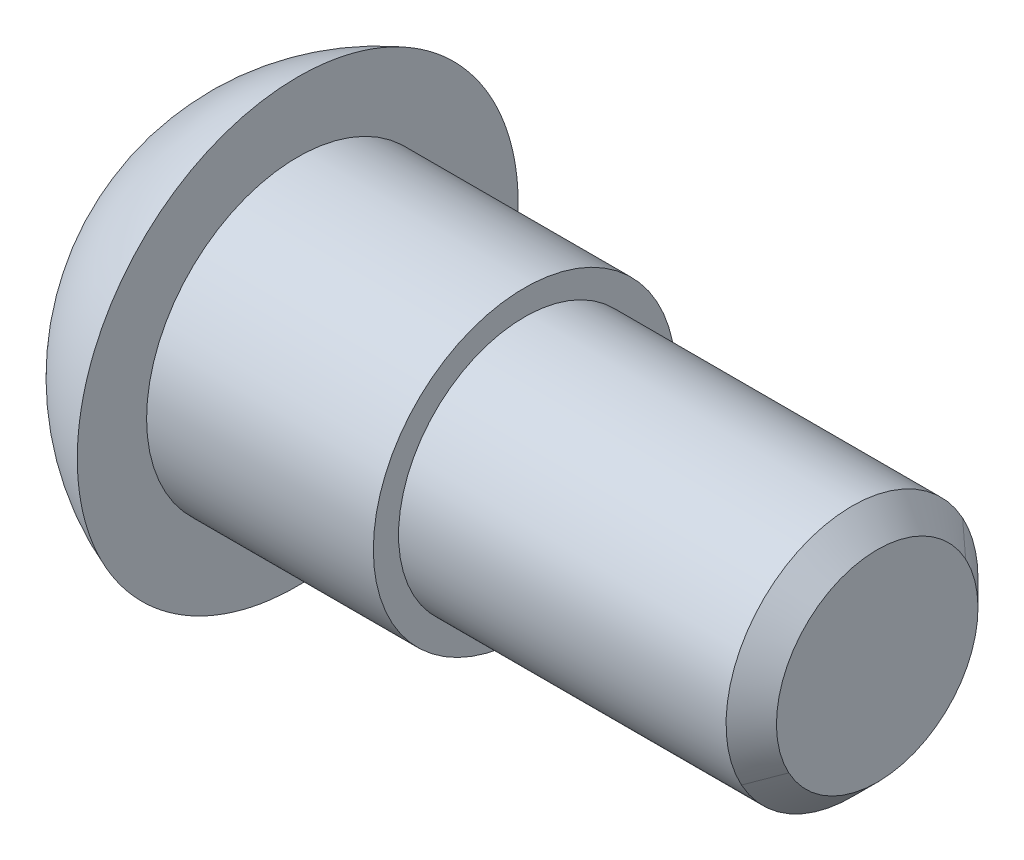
ISO-10303-21;
HEADER;
FILE_DESCRIPTION(('STEP AP214'),'2;1');
FILE_NAME('part.step','',(''),(''),'','','');
FILE_SCHEMA(('AUTOMOTIVE_DESIGN { 1 0 10303 214 1 1 1 1 }'));
ENDSEC;
DATA;
#1=APPLICATION_CONTEXT('core data for automotive mechanical design processes');
#2=APPLICATION_PROTOCOL_DEFINITION('international standard','automotive_design',2000,#1);
#3=PRODUCT_CONTEXT('',#1,'mechanical');
#4=PRODUCT('Part','Part','',(#3));
#5=PRODUCT_RELATED_PRODUCT_CATEGORY('part','',(#4));
#6=PRODUCT_DEFINITION_FORMATION('','',#4);
#7=PRODUCT_DEFINITION_CONTEXT('part definition',#1,'design');
#8=PRODUCT_DEFINITION('design','',#6,#7);
#9=PRODUCT_DEFINITION_SHAPE('','',#8);
#10=(LENGTH_UNIT() NAMED_UNIT(*) SI_UNIT(.MILLI.,.METRE.));
#11=(NAMED_UNIT(*) PLANE_ANGLE_UNIT() SI_UNIT($,.RADIAN.));
#12=(NAMED_UNIT(*) SI_UNIT($,.STERADIAN.) SOLID_ANGLE_UNIT());
#13=UNCERTAINTY_MEASURE_WITH_UNIT(LENGTH_MEASURE(1.E-05),#10,'distance_accuracy_value','');
#14=(GEOMETRIC_REPRESENTATION_CONTEXT(3) GLOBAL_UNCERTAINTY_ASSIGNED_CONTEXT((#13)) GLOBAL_UNIT_ASSIGNED_CONTEXT((#10,
#11,#12)) REPRESENTATION_CONTEXT('',''));
#15=CARTESIAN_POINT('',(0.,0.,0.));
#16=DIRECTION('',(0.,0.,1.));
#17=DIRECTION('',(1.,0.,0.));
#18=AXIS2_PLACEMENT_3D('',#15,#16,#17);
#19=CARTESIAN_POINT('',(-2.05766977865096,0.,0.));
#20=DIRECTION('',(-1.,0.,0.));
#21=DIRECTION('',(0.,0.,1.));
#22=AXIS2_PLACEMENT_3D('',#19,#20,#21);
#23=CONICAL_SURFACE('',#22,2.90497562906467,1.04719755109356);
#24=CARTESIAN_POINT('',(-2.04766666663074,-2.50077802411,-1.4438248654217));
#25=CARTESIAN_POINT('',(-2.01344823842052,-2.50077802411,-1.32530116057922));
#26=CARTESIAN_POINT('',(-1.98212030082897,-2.50077802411,-1.20583982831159));
#27=CARTESIAN_POINT('',(-1.92675205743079,-2.50077802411,-0.964976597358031));
#28=CARTESIAN_POINT('',(-1.90272805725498,-2.50077802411,-0.843570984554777));
#29=CARTESIAN_POINT('',(-1.8640945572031,-2.50077802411,-0.602122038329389));
#30=CARTESIAN_POINT('',(-1.84927907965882,-2.50077802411,-0.482112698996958));
#31=CARTESIAN_POINT('',(-1.82939017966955,-2.50077802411,-0.241401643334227));
#32=CARTESIAN_POINT('',(-1.82430618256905,-2.50077802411,-0.120700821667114));
#33=CARTESIAN_POINT('',(-1.82430618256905,-2.50077802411,0.120700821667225));
#34=CARTESIAN_POINT('',(-1.82939017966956,-2.50077802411,0.241401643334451));
#35=CARTESIAN_POINT('',(-1.84927907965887,-2.50077802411,0.482112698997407));
#36=CARTESIAN_POINT('',(-1.86409455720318,-2.50077802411,0.602122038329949));
#37=CARTESIAN_POINT('',(-1.90272805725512,-2.50077802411,0.843570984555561));
#38=CARTESIAN_POINT('',(-1.92675205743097,-2.50077802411,0.964976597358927));
#39=CARTESIAN_POINT('',(-1.98212030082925,-2.50077802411,1.20583982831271));
#40=CARTESIAN_POINT('',(-2.01344823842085,-2.50077802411,1.32530116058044));
#41=CARTESIAN_POINT('',(-2.04766666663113,-2.50077802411,1.44382486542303));
#42=B_SPLINE_CURVE_WITH_KNOTS('',3,(#24,#25,#26,#27,#28,#29,#30,#31,#32,#33,#34,#35,#36,#37,#38,
#39,#40,#41),.UNSPECIFIED.,.F.,.F.,(4,2,2,2,2,2,2,2,4),(0.,0.370206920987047,0.741234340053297,
1.10363192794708,1.46563549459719,1.82763906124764,2.19003664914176,2.56106406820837,
2.93127098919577),.UNSPECIFIED.);
#43=CARTESIAN_POINT('',(-2.04766666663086,-2.50077802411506,-1.44382486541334));
#44=VERTEX_POINT('',#43);
#45=CARTESIAN_POINT('',(-2.04766666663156,-2.50077802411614,1.44382486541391));
#46=VERTEX_POINT('',#45);
#47=EDGE_CURVE('E87',#44,#46,#42,.T.);
#48=ORIENTED_EDGE('',*,*,#47,.T.);
#49=CARTESIAN_POINT('',(-2.04766666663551,-2.50077802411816,1.44382486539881));
#50=CARTESIAN_POINT('',(-2.01102469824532,-2.3908839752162,1.5072722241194));
#51=CARTESIAN_POINT('',(-1.97770074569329,-2.2800413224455,1.57126725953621));
#52=CARTESIAN_POINT('',(-1.91953478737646,-2.05643685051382,1.70036536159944));
#53=CARTESIAN_POINT('',(-1.8947133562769,-1.94367105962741,1.7654707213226));
#54=CARTESIAN_POINT('',(-1.85607700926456,-1.71953692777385,1.89487462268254));
#55=CARTESIAN_POINT('',(-1.84200491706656,-1.60820306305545,1.9591532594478));
#56=CARTESIAN_POINT('',(-1.82520891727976,-1.38501174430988,2.0880128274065));
#57=CARTESIAN_POINT('',(-1.82247109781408,-1.27315510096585,2.15259329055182));
#58=CARTESIAN_POINT('',(-1.82818124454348,-1.06416296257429,2.27325495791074));
#59=CARTESIAN_POINT('',(-1.83522718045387,-0.966996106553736,2.32935426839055));
#60=CARTESIAN_POINT('',(-1.85755414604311,-0.773295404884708,2.44118742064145));
#61=CARTESIAN_POINT('',(-1.87284279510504,-0.676762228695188,2.49692087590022));
#62=CARTESIAN_POINT('',(-1.91106145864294,-0.482662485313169,2.60898441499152));
#63=CARTESIAN_POINT('',(-1.93415340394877,-0.385120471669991,2.66530032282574));
#64=CARTESIAN_POINT('',(-1.98656235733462,-0.191490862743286,2.77709242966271));
#65=CARTESIAN_POINT('',(-2.01586705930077,-0.0954007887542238,2.83257005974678));
#66=CARTESIAN_POINT('',(-2.04766666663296,8.40144272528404E-12,2.88764973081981));
#67=B_SPLINE_CURVE_WITH_KNOTS('',3,(#49,#50,#51,#52,#53,#54,#55,#56,#57,#58,#59,#60,#61,#62,#63,
#64,#65,#66),.UNSPECIFIED.,.F.,.F.,(4,2,2,2,2,2,2,2,4),(0.,0.396393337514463,0.793739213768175,
1.18125201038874,1.56828902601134,1.90522746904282,2.24247790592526,2.58720694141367,
2.93125941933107),.UNSPECIFIED.);
#68=CARTESIAN_POINT('',(-2.04766666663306,-2.97348732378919E-13,2.88764973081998));
#69=VERTEX_POINT('',#68);
#70=EDGE_CURVE('E90',#46,#69,#67,.T.);
#71=ORIENTED_EDGE('',*,*,#70,.T.);
#72=CARTESIAN_POINT('',(-2.04766666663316,-8.99585790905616E-12,2.88764973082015));
#73=CARTESIAN_POINT('',(-2.01102469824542,0.109894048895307,2.82420237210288));
#74=CARTESIAN_POINT('',(-1.97770074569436,0.220736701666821,2.76020733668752));
#75=CARTESIAN_POINT('',(-1.9195347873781,0.444341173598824,2.63110923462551));
#76=CARTESIAN_POINT('',(-1.89471335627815,0.557106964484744,2.56600387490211));
#77=CARTESIAN_POINT('',(-1.85607700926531,0.781241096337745,2.43659997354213));
#78=CARTESIAN_POINT('',(-1.8420049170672,0.892574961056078,2.37232133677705));
#79=CARTESIAN_POINT('',(-1.82520891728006,1.1157662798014,2.24346176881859));
#80=CARTESIAN_POINT('',(-1.82247109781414,1.22762292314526,2.17888130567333));
#81=CARTESIAN_POINT('',(-1.82818124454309,1.43661506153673,2.05821963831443));
#82=CARTESIAN_POINT('',(-1.83522718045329,1.53378191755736,2.00212032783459));
#83=CARTESIAN_POINT('',(-1.85755414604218,1.72748261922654,1.89028717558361));
#84=CARTESIAN_POINT('',(-1.87284279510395,1.82401579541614,1.83455372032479));
#85=CARTESIAN_POINT('',(-1.91106145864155,2.01811553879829,1.7224901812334));
#86=CARTESIAN_POINT('',(-1.93415340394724,2.11565755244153,1.66617427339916));
#87=CARTESIAN_POINT('',(-1.98656235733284,2.30928716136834,1.55438216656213));
#88=CARTESIAN_POINT('',(-2.01586705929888,2.40537723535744,1.49890453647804));
#89=CARTESIAN_POINT('',(-2.04766666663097,2.50077802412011,1.44382486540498));
#90=B_SPLINE_CURVE_WITH_KNOTS('',3,(#72,#73,#74,#75,#76,#77,#78,#79,#80,#81,#82,#83,#84,#85,#86,
#87,#88,#89),.UNSPECIFIED.,.F.,.F.,(4,2,2,2,2,2,2,2,4),(0.,0.396393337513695,0.793739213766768,
1.18125201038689,1.56828902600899,1.90522746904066,2.24247790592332,2.58720694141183,
2.93125941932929),.UNSPECIFIED.);
#91=CARTESIAN_POINT('',(-2.04766666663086,2.50077802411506,1.44382486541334));
#92=VERTEX_POINT('',#91);
#93=EDGE_CURVE('E124',#69,#92,#90,.T.);
#94=ORIENTED_EDGE('',*,*,#93,.T.);
#95=CARTESIAN_POINT('',(-2.04766666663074,2.50077802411,1.4438248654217));
#96=CARTESIAN_POINT('',(-2.01344823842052,2.50077802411,1.32530116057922));
#97=CARTESIAN_POINT('',(-1.98212030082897,2.50077802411,1.20583982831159));
#98=CARTESIAN_POINT('',(-1.92675205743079,2.50077802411,0.964976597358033));
#99=CARTESIAN_POINT('',(-1.90272805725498,2.50077802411,0.84357098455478));
#100=CARTESIAN_POINT('',(-1.8640945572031,2.50077802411,0.602122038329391));
#101=CARTESIAN_POINT('',(-1.84927907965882,2.50077802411,0.48211269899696));
#102=CARTESIAN_POINT('',(-1.82939017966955,2.50077802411,0.241401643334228));
#103=CARTESIAN_POINT('',(-1.82430618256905,2.50077802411,0.120700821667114));
#104=CARTESIAN_POINT('',(-1.82430618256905,2.50077802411,-0.120700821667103));
#105=CARTESIAN_POINT('',(-1.82939017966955,2.50077802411,-0.241401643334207));
#106=CARTESIAN_POINT('',(-1.84927907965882,2.50077802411,-0.482112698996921));
#107=CARTESIAN_POINT('',(-1.8640945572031,2.50077802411,-0.602122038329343));
#108=CARTESIAN_POINT('',(-1.90272805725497,2.50077802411,-0.843570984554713));
#109=CARTESIAN_POINT('',(-1.92675205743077,2.50077802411,-0.964976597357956));
#110=CARTESIAN_POINT('',(-1.98212030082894,2.50077802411,-1.2058398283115));
#111=CARTESIAN_POINT('',(-2.01344823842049,2.50077802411,-1.32530116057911));
#112=CARTESIAN_POINT('',(-2.04766666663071,2.50077802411,-1.44382486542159));
#113=B_SPLINE_CURVE_WITH_KNOTS('',3,(#95,#96,#97,#98,#99,#100,#101,#102,#103,#104,#105,#106,
#107,#108,#109,#110,#111,#112),.UNSPECIFIED.,.F.,.F.,(4,2,2,2,2,2,2,2,4),(0.,0.370206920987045,
0.741234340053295,1.10363192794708,1.46563549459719,1.82763906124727,2.19003664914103,
2.56106406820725,2.93127098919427),.UNSPECIFIED.);
#114=CARTESIAN_POINT('',(-2.04766666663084,2.50077802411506,-1.44382486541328));
#115=VERTEX_POINT('',#114);
#116=EDGE_CURVE('E129',#92,#115,#113,.T.);
#117=ORIENTED_EDGE('',*,*,#116,.T.);
#118=CARTESIAN_POINT('',(-2.04766666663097,2.50077802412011,-1.44382486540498));
#119=CARTESIAN_POINT('',(-2.01102469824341,2.39088397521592,-1.50727222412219));
#120=CARTESIAN_POINT('',(-1.97770074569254,2.28004132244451,-1.57126725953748));
#121=CARTESIAN_POINT('',(-1.91953478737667,2.05643685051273,-1.70036536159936));
#122=CARTESIAN_POINT('',(-1.89471335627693,1.94367105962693,-1.7654707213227));
#123=CARTESIAN_POINT('',(-1.8560770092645,1.71953692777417,-1.89487462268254));
#124=CARTESIAN_POINT('',(-1.84200491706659,1.60820306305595,-1.95915325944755));
#125=CARTESIAN_POINT('',(-1.82520891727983,1.38501174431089,-2.08801282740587));
#126=CARTESIAN_POINT('',(-1.82247109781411,1.27315510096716,-2.15259329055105));
#127=CARTESIAN_POINT('',(-1.82818124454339,1.0641629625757,-2.27325495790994));
#128=CARTESIAN_POINT('',(-1.83522718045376,0.966996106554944,-2.32935426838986));
#129=CARTESIAN_POINT('',(-1.85755414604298,0.773295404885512,-2.44118742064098));
#130=CARTESIAN_POINT('',(-1.87284279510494,0.676762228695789,-2.49692087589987));
#131=CARTESIAN_POINT('',(-1.91106145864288,0.482662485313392,-2.60898441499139));
#132=CARTESIAN_POINT('',(-1.93415340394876,0.385120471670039,-2.66530032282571));
#133=CARTESIAN_POINT('',(-1.9865623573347,0.191490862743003,-2.77709242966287));
#134=CARTESIAN_POINT('',(-2.01586705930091,0.0954007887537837,-2.83257005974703));
#135=CARTESIAN_POINT('',(-2.04766666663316,-8.99572751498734E-12,-2.88764973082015));
#136=B_SPLINE_CURVE_WITH_KNOTS('',3,(#118,#119,#120,#121,#122,#123,#124,#125,#126,#127,#128,
#129,#130,#131,#132,#133,#134,#135),.UNSPECIFIED.,.F.,.F.,(4,2,2,2,2,2,2,2,4),(0.,
0.396393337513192,0.793739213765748,1.18125201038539,1.56828902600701,1.90522746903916,
2.24247790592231,2.58720694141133,2.9312594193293),.UNSPECIFIED.);
#137=CARTESIAN_POINT('',(-2.0476666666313,-5.57113034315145E-12,-2.88764973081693));
#138=VERTEX_POINT('',#137);
#139=EDGE_CURVE('E20',#115,#138,#136,.T.);
#140=ORIENTED_EDGE('',*,*,#139,.T.);
#141=CARTESIAN_POINT('',(-2.04766666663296,8.40110502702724E-12,-2.88764973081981));
#142=CARTESIAN_POINT('',(-2.01102469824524,-0.109894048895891,-2.82420237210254));
#143=CARTESIAN_POINT('',(-1.97770074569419,-0.220736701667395,-2.76020733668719));
#144=CARTESIAN_POINT('',(-1.91953478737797,-0.444341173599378,-2.63110923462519));
#145=CARTESIAN_POINT('',(-1.89471335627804,-0.557106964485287,-2.5660038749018));
#146=CARTESIAN_POINT('',(-1.85607700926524,-0.781241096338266,-2.43659997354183));
#147=CARTESIAN_POINT('',(-1.84200491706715,-0.892574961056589,-2.37232133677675));
#148=CARTESIAN_POINT('',(-1.82520891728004,-1.11576627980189,-2.2434617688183));
#149=CARTESIAN_POINT('',(-1.82247109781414,-1.22762292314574,-2.17888130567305));
#150=CARTESIAN_POINT('',(-1.82818124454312,-1.43661506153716,-2.05821963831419));
#151=CARTESIAN_POINT('',(-1.83522718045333,-1.53378191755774,-2.00212032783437));
#152=CARTESIAN_POINT('',(-1.85755414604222,-1.72748261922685,-1.89028717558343));
#153=CARTESIAN_POINT('',(-1.872842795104,-1.82401579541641,-1.83455372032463));
#154=CARTESIAN_POINT('',(-1.91106145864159,-2.01811553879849,-1.72249018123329));
#155=CARTESIAN_POINT('',(-1.93415340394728,-2.11565755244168,-1.66617427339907));
#156=CARTESIAN_POINT('',(-1.98656235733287,-2.30928716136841,-1.55438216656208));
#157=CARTESIAN_POINT('',(-2.01586705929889,-2.40537723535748,-1.49890453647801));
#158=CARTESIAN_POINT('',(-2.04766666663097,-2.50077802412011,-1.44382486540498));
#159=B_SPLINE_CURVE_WITH_KNOTS('',3,(#141,#142,#143,#144,#145,#146,#147,#148,#149,#150,#151,
#152,#153,#154,#155,#156,#157,#158),.UNSPECIFIED.,.F.,.F.,(4,2,2,2,2,2,2,2,4),(0.,
0.396393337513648,0.793739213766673,1.18125201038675,1.56828902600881,1.90522746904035,
2.24247790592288,2.58720694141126,2.93125941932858),.UNSPECIFIED.);
#160=EDGE_CURVE('E93',#138,#44,#159,.T.);
#161=ORIENTED_EDGE('',*,*,#160,.T.);
#162=EDGE_LOOP('',(#48,#71,#94,#117,#140,#161));
#163=FACE_BOUND('',#162,.T.);
#164=CARTESIAN_POINT('',(-0.380481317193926,-3.41060513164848E-10,0.));
#165=VERTEX_POINT('',#164);
#166=VERTEX_LOOP('',#165);
#167=FACE_BOUND('',#166,.T.);
#168=ADVANCED_FACE('F16',(#163,#167),#23,.F.);
#169=CARTESIAN_POINT('',(-5.501,1.25038901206,-2.16573729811));
#170=DIRECTION('',(0.,0.50000000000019,-0.866025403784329));
#171=DIRECTION('',(0.,0.866025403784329,0.50000000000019));
#172=AXIS2_PLACEMENT_3D('',#169,#170,#171);
#173=PLANE('',#172);
#174=DIRECTION('',(0.,0.86602540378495,0.499999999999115));
#175=VECTOR('',#174,1.);
#176=CARTESIAN_POINT('',(-5.5,0.,-2.88764973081));
#177=LINE('',#176,#175);
#178=CARTESIAN_POINT('',(-5.5,-2.1462866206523E-12,-2.88764973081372));
#179=VERTEX_POINT('',#178);
#180=CARTESIAN_POINT('',(-5.5,2.50077802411,-1.4438248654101));
#181=VERTEX_POINT('',#180);
#182=EDGE_CURVE('E132',#179,#181,#177,.T.);
#183=ORIENTED_EDGE('',*,*,#182,.F.);
#184=DIRECTION('',(1.,0.,0.));
#185=VECTOR('',#184,1.);
#186=CARTESIAN_POINT('',(-5.501,-2.1462866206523E-12,-2.88764973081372));
#187=LINE('',#186,#185);
#188=EDGE_CURVE('E136',#179,#138,#187,.T.);
#189=ORIENTED_EDGE('',*,*,#188,.T.);
#190=ORIENTED_EDGE('',*,*,#139,.F.);
#191=DIRECTION('',(1.,0.,0.));
#192=VECTOR('',#191,1.);
#193=CARTESIAN_POINT('',(-5.501,2.50077802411,-1.44382486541));
#194=LINE('',#193,#192);
#195=EDGE_CURVE('E127',#115,#181,#194,.F.);
#196=ORIENTED_EDGE('',*,*,#195,.T.);
#197=EDGE_LOOP('',(#183,#189,#190,#196));
#198=FACE_BOUND('',#197,.T.);
#199=ADVANCED_FACE('F238',(#198),#173,.F.);
#200=CARTESIAN_POINT('',(-5.501,2.50077802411,0.));
#201=DIRECTION('',(0.,1.,0.));
#202=DIRECTION('',(0.,0.,1.));
#203=AXIS2_PLACEMENT_3D('',#200,#201,#202);
#204=PLANE('',#203);
#205=DIRECTION('',(1.,0.,0.));
#206=VECTOR('',#205,1.);
#207=CARTESIAN_POINT('',(-5.501,2.50077802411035,1.44382486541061));
#208=LINE('',#207,#206);
#209=CARTESIAN_POINT('',(-5.5,2.50077802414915,1.44382486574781));
#210=VERTEX_POINT('',#209);
#211=EDGE_CURVE('E105',#92,#210,#208,.F.);
#212=ORIENTED_EDGE('',*,*,#211,.T.);
#213=DIRECTION('',(0.,0.,1.));
#214=VECTOR('',#213,1.);
#215=CARTESIAN_POINT('',(-5.5,2.50077802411,0.));
#216=LINE('',#215,#214);
#217=EDGE_CURVE('E135',#181,#210,#216,.T.);
#218=ORIENTED_EDGE('',*,*,#217,.F.);
#219=ORIENTED_EDGE('',*,*,#195,.F.);
#220=ORIENTED_EDGE('',*,*,#116,.F.);
#221=EDGE_LOOP('',(#212,#218,#219,#220));
#222=FACE_BOUND('',#221,.T.);
#223=ADVANCED_FACE('F233',(#222),#204,.F.);
#224=CARTESIAN_POINT('',(-5.501,1.25038901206,2.16573729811));
#225=DIRECTION('',(0.,0.50000000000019,0.866025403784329));
#226=DIRECTION('',(0.,-0.866025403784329,0.50000000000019));
#227=AXIS2_PLACEMENT_3D('',#224,#225,#226);
#228=PLANE('',#227);
#229=DIRECTION('',(0.,-0.866025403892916,0.499999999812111));
#230=VECTOR('',#229,1.);
#231=CARTESIAN_POINT('',(-5.5,2.50077802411,1.44382486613));
#232=LINE('',#231,#230);
#233=CARTESIAN_POINT('',(-5.5,-2.68471195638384E-13,2.88764973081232));
#234=VERTEX_POINT('',#233);
#235=EDGE_CURVE('E150',#210,#234,#232,.T.);
#236=ORIENTED_EDGE('',*,*,#235,.F.);
#237=ORIENTED_EDGE('',*,*,#211,.F.);
#238=ORIENTED_EDGE('',*,*,#93,.F.);
#239=DIRECTION('',(1.,0.,0.));
#240=VECTOR('',#239,1.);
#241=CARTESIAN_POINT('',(-5.501,-2.1462866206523E-12,2.88764973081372));
#242=LINE('',#241,#240);
#243=EDGE_CURVE('E98',#69,#234,#242,.F.);
#244=ORIENTED_EDGE('',*,*,#243,.T.);
#245=EDGE_LOOP('',(#236,#237,#238,#244));
#246=FACE_BOUND('',#245,.T.);
#247=ADVANCED_FACE('F216',(#246),#228,.F.);
#248=CARTESIAN_POINT('',(-5.501,-1.25038901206,2.16573729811));
#249=DIRECTION('',(0.,-0.50000000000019,0.866025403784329));
#250=DIRECTION('',(0.,-0.866025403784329,-0.50000000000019));
#251=AXIS2_PLACEMENT_3D('',#248,#249,#250);
#252=PLANE('',#251);
#253=ORIENTED_EDGE('',*,*,#243,.F.);
#254=ORIENTED_EDGE('',*,*,#70,.F.);
#255=DIRECTION('',(1.,0.,0.));
#256=VECTOR('',#255,1.);
#257=CARTESIAN_POINT('',(-5.501,-2.50077802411,1.44382486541));
#258=LINE('',#257,#256);
#259=CARTESIAN_POINT('',(-5.5,-2.50077802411,1.44382486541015));
#260=VERTEX_POINT('',#259);
#261=EDGE_CURVE('E97',#46,#260,#258,.F.);
#262=ORIENTED_EDGE('',*,*,#261,.T.);
#263=DIRECTION('',(0.,-0.86602540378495,-0.499999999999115));
#264=VECTOR('',#263,1.);
#265=CARTESIAN_POINT('',(-5.5,0.,2.88764973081));
#266=LINE('',#265,#264);
#267=EDGE_CURVE('E146',#234,#260,#266,.T.);
#268=ORIENTED_EDGE('',*,*,#267,.F.);
#269=EDGE_LOOP('',(#253,#254,#262,#268));
#270=FACE_BOUND('',#269,.T.);
#271=ADVANCED_FACE('F102',(#270),#252,.F.);
#272=CARTESIAN_POINT('',(-5.501,-2.50077802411,0.));
#273=DIRECTION('',(0.,-1.,0.));
#274=DIRECTION('',(0.,0.,-1.));
#275=AXIS2_PLACEMENT_3D('',#272,#273,#274);
#276=PLANE('',#275);
#277=DIRECTION('',(0.,0.,1.));
#278=VECTOR('',#277,1.);
#279=CARTESIAN_POINT('',(-5.5,-2.50077802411,0.));
#280=LINE('',#279,#278);
#281=CARTESIAN_POINT('',(-5.5,-2.50077802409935,-1.44382486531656));
#282=VERTEX_POINT('',#281);
#283=EDGE_CURVE('E109',#260,#282,#280,.F.);
#284=ORIENTED_EDGE('',*,*,#283,.F.);
#285=ORIENTED_EDGE('',*,*,#261,.F.);
#286=ORIENTED_EDGE('',*,*,#47,.F.);
#287=DIRECTION('',(1.,0.,0.));
#288=VECTOR('',#287,1.);
#289=CARTESIAN_POINT('',(-5.501,-2.50077802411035,-1.44382486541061));
#290=LINE('',#289,#288);
#291=EDGE_CURVE('E112',#44,#282,#290,.F.);
#292=ORIENTED_EDGE('',*,*,#291,.T.);
#293=EDGE_LOOP('',(#284,#285,#286,#292));
#294=FACE_BOUND('',#293,.T.);
#295=ADVANCED_FACE('F107',(#294),#276,.F.);
#296=CARTESIAN_POINT('',(-5.501,-1.25038901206,-2.16573729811));
#297=DIRECTION('',(0.,-0.50000000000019,-0.866025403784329));
#298=DIRECTION('',(0.,0.866025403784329,-0.50000000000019));
#299=AXIS2_PLACEMENT_3D('',#296,#297,#298);
#300=PLANE('',#299);
#301=DIRECTION('',(0.,0.866025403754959,-0.50000000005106));
#302=VECTOR('',#301,1.);
#303=CARTESIAN_POINT('',(-5.5,-2.50077802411,-1.44382486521));
#304=LINE('',#303,#302);
#305=EDGE_CURVE('E139',#282,#179,#304,.T.);
#306=ORIENTED_EDGE('',*,*,#305,.F.);
#307=ORIENTED_EDGE('',*,*,#291,.F.);
#308=ORIENTED_EDGE('',*,*,#160,.F.);
#309=ORIENTED_EDGE('',*,*,#188,.F.);
#310=EDGE_LOOP('',(#306,#307,#308,#309));
#311=FACE_BOUND('',#310,.T.);
#312=ADVANCED_FACE('F209',(#311),#300,.F.);
#313=CARTESIAN_POINT('',(-5.5,2.2650822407,0.));
#314=DIRECTION('',(-1.,0.,0.));
#315=DIRECTION('',(0.,-1.,0.));
#316=AXIS2_PLACEMENT_3D('',#313,#314,#315);
#317=PLANE('',#316);
#318=ORIENTED_EDGE('',*,*,#283,.T.);
#319=ORIENTED_EDGE('',*,*,#305,.T.);
#320=ORIENTED_EDGE('',*,*,#182,.T.);
#321=ORIENTED_EDGE('',*,*,#217,.T.);
#322=ORIENTED_EDGE('',*,*,#235,.T.);
#323=ORIENTED_EDGE('',*,*,#267,.T.);
#324=EDGE_LOOP('',(#318,#319,#320,#321,#322,#323));
#325=FACE_BOUND('',#324,.T.);
#326=CARTESIAN_POINT('',(-5.5,-1.6241257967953,2.97294232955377));
#327=CARTESIAN_POINT('',(-5.50000000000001,-1.70759642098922,2.92734147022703));
#328=CARTESIAN_POINT('',(-5.50000000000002,-1.78916074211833,2.87821468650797));
#329=CARTESIAN_POINT('',(-5.49999999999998,-1.94788110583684,2.77326308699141));
#330=CARTESIAN_POINT('',(-5.49999999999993,-2.02503583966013,2.71743629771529));
#331=CARTESIAN_POINT('',(-5.50000000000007,-2.17449735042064,2.59938641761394));
#332=CARTESIAN_POINT('',(-5.50000000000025,-2.24679621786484,2.53715329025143));
#333=CARTESIAN_POINT('',(-5.49999999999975,-2.38593385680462,2.40678187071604));
#334=CARTESIAN_POINT('',(-5.49999999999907,-2.45276814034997,2.33863881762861));
#335=CARTESIAN_POINT('',(-5.49999999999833,-2.64405647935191,2.12633802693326));
#336=CARTESIAN_POINT('',(-5.49999999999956,-2.75965702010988,1.97402289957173));
#337=CARTESIAN_POINT('',(-5.50000000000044,-2.96360884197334,1.65211977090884));
#338=CARTESIAN_POINT('',(-5.50000000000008,-3.05195908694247,1.48253111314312));
#339=CARTESIAN_POINT('',(-5.49999999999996,-3.16218025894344,1.21897468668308));
#340=CARTESIAN_POINT('',(-5.49999999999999,-3.19521757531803,1.12953214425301));
#341=CARTESIAN_POINT('',(-5.50000000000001,-3.25362017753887,0.94824899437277));
#342=CARTESIAN_POINT('',(-5.5,-3.27899282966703,0.856410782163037));
#343=CARTESIAN_POINT('',(-5.5,-3.32192100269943,0.670880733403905));
#344=CARTESIAN_POINT('',(-5.5,-3.33947297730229,0.577188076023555));
#345=CARTESIAN_POINT('',(-5.5,-3.36663020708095,0.38866019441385));
#346=CARTESIAN_POINT('',(-5.5,-3.37623362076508,0.293824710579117));
#347=CARTESIAN_POINT('',(-5.50000000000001,-3.39297258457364,0.00866198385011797));
#348=CARTESIAN_POINT('',(-5.5,-3.38808200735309,-0.182517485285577));
#349=CARTESIAN_POINT('',(-5.5,-3.34627124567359,-0.561235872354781));
#350=CARTESIAN_POINT('',(-5.5,-3.3093514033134,-0.74877482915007));
#351=CARTESIAN_POINT('',(-5.5,-3.20455290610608,-1.11502061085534));
#352=CARTESIAN_POINT('',(-5.5,-3.13667408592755,-1.29372738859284));
#353=CARTESIAN_POINT('',(-5.5,-2.97187079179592,-1.63720459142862));
#354=CARTESIAN_POINT('',(-5.5,-2.87494631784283,-1.80197501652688));
#355=CARTESIAN_POINT('',(-5.5,-2.65483580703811,-2.11289310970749));
#356=CARTESIAN_POINT('',(-5.5,-2.53164991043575,-2.25904087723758));
#357=CARTESIAN_POINT('',(-5.5,-2.2623969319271,-2.52863054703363));
#358=CARTESIAN_POINT('',(-5.5,-2.11632960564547,-2.65207220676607));
#359=CARTESIAN_POINT('',(-5.5,-1.88341737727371,-2.81745016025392));
#360=CARTESIAN_POINT('',(-5.5,-1.80343281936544,-2.86930057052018));
#361=CARTESIAN_POINT('',(-5.5,-1.63938054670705,-2.96608450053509));
#362=CARTESIAN_POINT('',(-5.5,-1.55531378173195,-3.01101961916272));
#363=CARTESIAN_POINT('',(-5.5,-1.38373157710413,-3.09362575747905));
#364=CARTESIAN_POINT('',(-5.5,-1.29621771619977,-3.13130005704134));
#365=CARTESIAN_POINT('',(-5.5,-1.11826543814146,-3.199178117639));
#366=CARTESIAN_POINT('',(-5.5,-1.02782428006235,-3.22937463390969));
#367=CARTESIAN_POINT('',(-5.5,-0.753271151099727,-3.30831306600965));
#368=CARTESIAN_POINT('',(-5.5,-0.565701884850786,-3.34551318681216));
#369=CARTESIAN_POINT('',(-5.5,-0.186985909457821,-3.38784733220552));
#370=CARTESIAN_POINT('',(-5.5,0.00416066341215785,-3.39298257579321));
#371=CARTESIAN_POINT('',(-5.5,0.289458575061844,-3.37661321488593));
#372=CARTESIAN_POINT('',(-5.5,0.384433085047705,-3.36711902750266));
#373=CARTESIAN_POINT('',(-5.5,0.573190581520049,-3.34016356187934));
#374=CARTESIAN_POINT('',(-5.5,0.666974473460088,-3.32270876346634));
#375=CARTESIAN_POINT('',(-5.5,0.852580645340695,-3.27999030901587));
#376=CARTESIAN_POINT('',(-5.5,0.944405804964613,-3.25473910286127));
#377=CARTESIAN_POINT('',(-5.5,1.12558834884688,-3.19660238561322));
#378=CARTESIAN_POINT('',(-5.5,1.21494645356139,-3.16371913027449));
#379=CARTESIAN_POINT('',(-5.5,1.35761774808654,-3.10428421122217));
#380=CARTESIAN_POINT('',(-5.5,1.41188015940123,-3.07998337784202));
#381=CARTESIAN_POINT('',(-5.5,1.51905182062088,-3.02856149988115));
#382=CARTESIAN_POINT('',(-5.5,1.57196107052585,-3.00144045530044));
#383=CARTESIAN_POINT('',(-5.5,1.70759642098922,-2.92734147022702));
#384=CARTESIAN_POINT('',(-5.50000000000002,1.78916074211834,-2.87821468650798));
#385=CARTESIAN_POINT('',(-5.49999999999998,1.94788110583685,-2.77326308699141));
#386=CARTESIAN_POINT('',(-5.49999999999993,2.02503583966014,-2.71743629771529));
#387=CARTESIAN_POINT('',(-5.50000000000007,2.17449735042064,-2.59938641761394));
#388=CARTESIAN_POINT('',(-5.50000000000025,2.24679621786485,-2.53715329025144));
#389=CARTESIAN_POINT('',(-5.49999999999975,2.38593385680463,-2.40678187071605));
#390=CARTESIAN_POINT('',(-5.49999999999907,2.45276814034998,-2.33863881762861));
#391=CARTESIAN_POINT('',(-5.49999999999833,2.64405647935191,-2.12633802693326));
#392=CARTESIAN_POINT('',(-5.49999999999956,2.75965702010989,-1.97402289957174));
#393=CARTESIAN_POINT('',(-5.50000000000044,2.96360884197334,-1.65211977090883));
#394=CARTESIAN_POINT('',(-5.50000000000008,3.05195908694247,-1.48253111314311));
#395=CARTESIAN_POINT('',(-5.49999999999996,3.16218025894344,-1.21897468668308));
#396=CARTESIAN_POINT('',(-5.49999999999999,3.19521757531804,-1.12953214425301));
#397=CARTESIAN_POINT('',(-5.50000000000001,3.25362017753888,-0.948248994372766));
#398=CARTESIAN_POINT('',(-5.5,3.27899282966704,-0.856410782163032));
#399=CARTESIAN_POINT('',(-5.5,3.32192100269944,-0.670880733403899));
#400=CARTESIAN_POINT('',(-5.5,3.3394729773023,-0.577188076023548));
#401=CARTESIAN_POINT('',(-5.5,3.36663020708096,-0.388660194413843));
#402=CARTESIAN_POINT('',(-5.5,3.37623362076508,-0.293824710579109));
#403=CARTESIAN_POINT('',(-5.5,3.39297258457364,-0.00866198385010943));
#404=CARTESIAN_POINT('',(-5.5,3.3880820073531,0.182517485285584));
#405=CARTESIAN_POINT('',(-5.5,3.3462712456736,0.561235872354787));
#406=CARTESIAN_POINT('',(-5.5,3.3093514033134,0.748774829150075));
#407=CARTESIAN_POINT('',(-5.5,3.20455290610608,1.11502061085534));
#408=CARTESIAN_POINT('',(-5.5,3.13667408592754,1.29372738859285));
#409=CARTESIAN_POINT('',(-5.5,2.97187079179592,1.63720459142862));
#410=CARTESIAN_POINT('',(-5.5,2.87494631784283,1.80197501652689));
#411=CARTESIAN_POINT('',(-5.5,2.65483580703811,2.11289310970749));
#412=CARTESIAN_POINT('',(-5.5,2.53164991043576,2.25904087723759));
#413=CARTESIAN_POINT('',(-5.5,2.26239693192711,2.52863054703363));
#414=CARTESIAN_POINT('',(-5.5,2.11632960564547,2.65207220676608));
#415=CARTESIAN_POINT('',(-5.5,1.88341737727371,2.81745016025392));
#416=CARTESIAN_POINT('',(-5.5,1.80343281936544,2.86930057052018));
#417=CARTESIAN_POINT('',(-5.5,1.63938054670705,2.96608450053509));
#418=CARTESIAN_POINT('',(-5.5,1.55531378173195,3.01101961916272));
#419=CARTESIAN_POINT('',(-5.5,1.38373157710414,3.09362575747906));
#420=CARTESIAN_POINT('',(-5.5,1.29621771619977,3.13130005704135));
#421=CARTESIAN_POINT('',(-5.5,1.11826543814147,3.199178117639));
#422=CARTESIAN_POINT('',(-5.5,1.02782428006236,3.22937463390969));
#423=CARTESIAN_POINT('',(-5.5,0.75327115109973,3.30831306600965));
#424=CARTESIAN_POINT('',(-5.5,0.565701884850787,3.34551318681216));
#425=CARTESIAN_POINT('',(-5.5,0.186985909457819,3.38784733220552));
#426=CARTESIAN_POINT('',(-5.5,-0.00416066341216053,3.3929825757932));
#427=CARTESIAN_POINT('',(-5.5,-0.289458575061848,3.37661321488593));
#428=CARTESIAN_POINT('',(-5.5,-0.384433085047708,3.36711902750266));
#429=CARTESIAN_POINT('',(-5.5,-0.573190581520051,3.34016356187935));
#430=CARTESIAN_POINT('',(-5.5,-0.666974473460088,3.32270876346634));
#431=CARTESIAN_POINT('',(-5.5,-0.852580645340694,3.27999030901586));
#432=CARTESIAN_POINT('',(-5.5,-0.944405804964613,3.25473910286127));
#433=CARTESIAN_POINT('',(-5.5,-1.12558834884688,3.19660238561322));
#434=CARTESIAN_POINT('',(-5.5,-1.21494645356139,3.1637191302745));
#435=CARTESIAN_POINT('',(-5.5,-1.35761774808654,3.10428421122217));
#436=CARTESIAN_POINT('',(-5.5,-1.41188015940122,3.07998337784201));
#437=CARTESIAN_POINT('',(-5.5,-1.51905182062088,3.02856149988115));
#438=CARTESIAN_POINT('',(-5.5,-1.57196107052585,3.00144045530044));
#439=CARTESIAN_POINT('',(-5.5,-1.6241257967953,2.97294232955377));
#440=B_SPLINE_CURVE_WITH_KNOTS('',3,(#326,#327,#328,#329,#330,#331,#332,#333,#334,#335,#336,
#337,#338,#339,#340,#341,#342,#343,#344,#345,#346,#347,#348,#349,#350,#351,#352,#353,#354,#355,
#356,#357,#358,#359,#360,#361,#362,#363,#364,#365,#366,#367,#368,#369,#370,#371,#372,#373,#374,
#375,#376,#377,#378,#379,#380,#381,#382,#383,#384,#385,#386,#387,#388,#389,#390,#391,#392,#393,
#394,#395,#396,#397,#398,#399,#400,#401,#402,#403,#404,#405,#406,#407,#408,#409,#410,#411,#412,
#413,#414,#415,#416,#417,#418,#419,#420,#421,#422,#423,#424,#425,#426,#427,#428,#429,#430,#431,
#432,#433,#434,#435,#436,#437,#438,#439),.UNSPECIFIED.,.T.,.F.,(4,2,2,2,2,2,2,2,2,2,2,2,2,2,2,2,
2,2,2,2,2,2,2,2,2,2,2,2,2,2,2,2,2,2,2,2,2,2,2,2,2,2,2,2,2,2,2,2,2,2,2,2,2,2,2,2,4),(0.,
0.285289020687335,0.570662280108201,0.856489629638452,1.1425494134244,1.71330536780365,
2.2840830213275,2.5698458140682,2.85533308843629,3.14094968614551,3.42663243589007,
3.99740228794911,4.56816604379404,5.13893284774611,5.70969965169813,6.28046340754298,
6.8512332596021,7.13691600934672,7.42253260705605,7.70801988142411,7.99378267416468,
8.56456032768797,9.13531628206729,9.4213760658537,9.70720341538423,9.99257667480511,
10.2778656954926,10.4561562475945,10.6344467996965,10.9197358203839,11.2051090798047,
11.490936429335,11.7769962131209,12.3477521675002,12.918529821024,13.2042926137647,
13.4897798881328,13.775396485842,14.0610792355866,14.6318490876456,15.2026128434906,
15.7733796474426,16.3441464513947,16.9149102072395,17.4856800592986,17.7713628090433,
18.0569794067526,18.3424666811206,18.6282294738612,19.1990071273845,19.7697630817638,
20.0558228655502,20.3416502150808,20.6270234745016,20.9123124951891,21.0906030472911,
21.2688935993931),.UNSPECIFIED.);
#441=CARTESIAN_POINT('',(-5.5,-1.6241257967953,2.97294232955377));
#442=VERTEX_POINT('',#441);
#443=EDGE_CURVE('E142',#442,#442,#440,.T.);
#444=ORIENTED_EDGE('',*,*,#443,.F.);
#445=EDGE_LOOP('',(#444));
#446=FACE_BOUND('',#445,.T.);
#447=ADVANCED_FACE('F194',(#325,#446),#317,.T.);
#448=CARTESIAN_POINT('',(3.16693902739,0.,0.));
#449=DIRECTION('',(0.,-0.479425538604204,0.877582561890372));
#450=DIRECTION('',(0.,-0.877582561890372,-0.479425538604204));
#451=AXIS2_PLACEMENT_3D('',#448,#449,#450);
#452=SPHERICAL_SURFACE('',#451,9.30548240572);
#453=CARTESIAN_POINT('',(0.,8.74999999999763,0.));
#454=CARTESIAN_POINT('',(0.,8.74999866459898,0.245569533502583));
#455=CARTESIAN_POINT('',(0.,8.73965179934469,0.491217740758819));
#456=CARTESIAN_POINT('',(0.,8.69832208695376,0.980878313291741));
#457=CARTESIAN_POINT('',(0.,8.66732684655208,1.22488960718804));
#458=CARTESIAN_POINT('',(0.,8.58481853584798,1.7099834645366));
#459=CARTESIAN_POINT('',(0.,8.53326040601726,1.95105838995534));
#460=CARTESIAN_POINT('',(0.,8.40999246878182,2.42800338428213));
#461=CARTESIAN_POINT('',(0.,8.33828214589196,2.66387331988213));
#462=CARTESIAN_POINT('',(0.,8.17530195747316,3.12849580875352));
#463=CARTESIAN_POINT('',(0.,8.08405140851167,3.35725513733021));
#464=CARTESIAN_POINT('',(0.,7.88259434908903,3.80627913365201));
#465=CARTESIAN_POINT('',(0.,7.77238712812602,4.02654348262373));
#466=CARTESIAN_POINT('',(0.,7.53390317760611,4.45682124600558));
#467=CARTESIAN_POINT('',(0.,7.40564165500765,4.66684308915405));
#468=CARTESIAN_POINT('',(0.,7.13183224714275,5.07542833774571));
#469=CARTESIAN_POINT('',(0.,6.98627704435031,5.27398683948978));
#470=CARTESIAN_POINT('',(0.,6.67893829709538,5.65816252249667));
#471=CARTESIAN_POINT('',(0.,6.51715263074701,5.84377800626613));
#472=CARTESIAN_POINT('',(0.,6.17859117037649,6.20064349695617));
#473=CARTESIAN_POINT('',(0.,6.00182177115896,6.37189957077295));
#474=CARTESIAN_POINT('',(0.,5.6343854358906,6.69901018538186));
#475=CARTESIAN_POINT('',(0.,5.44371070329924,6.85485596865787));
#476=CARTESIAN_POINT('',(0.,5.04991119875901,7.14992533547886));
#477=CARTESIAN_POINT('',(0.,4.84678661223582,7.28914916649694));
#478=CARTESIAN_POINT('',(0.,4.42943753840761,7.55004439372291));
#479=CARTESIAN_POINT('',(0.,4.21520823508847,7.67170808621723));
#480=CARTESIAN_POINT('',(0.,3.77726024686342,7.89654318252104));
#481=CARTESIAN_POINT('',(0.,3.553541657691,7.9997147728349));
#482=CARTESIAN_POINT('',(0.,3.09844240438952,8.18673351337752));
#483=CARTESIAN_POINT('',(0.,2.86707018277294,8.27060119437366));
#484=CARTESIAN_POINT('',(0.,2.39816170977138,8.41853698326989));
#485=CARTESIAN_POINT('',(0.,2.16062696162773,8.48260987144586));
#486=CARTESIAN_POINT('',(0.,1.60598761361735,8.60740155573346));
#487=CARTESIAN_POINT('',(0.,1.2872126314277,8.66081606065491));
#488=CARTESIAN_POINT('',(0.,0.645605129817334,8.7321197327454));
#489=CARTESIAN_POINT('',(0.,0.322771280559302,8.74999693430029));
#490=CARTESIAN_POINT('',(0.,-0.246047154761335,8.75000233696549));
#491=CARTESIAN_POINT('',(0.,-0.492057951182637,8.73961810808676));
#492=CARTESIAN_POINT('',(0.,-0.982429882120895,8.69815369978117));
#493=CARTESIAN_POINT('',(0.,-1.22679045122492,8.66706675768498));
#494=CARTESIAN_POINT('',(0.,-1.71189310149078,8.58442995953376));
#495=CARTESIAN_POINT('',(0.,-1.95263695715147,8.53289050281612));
#496=CARTESIAN_POINT('',(0.,-2.42883090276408,8.40974032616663));
#497=CARTESIAN_POINT('',(0.,-2.66428317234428,8.33813804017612));
#498=CARTESIAN_POINT('',(0.,-3.12012413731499,8.17823889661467));
#499=CARTESIAN_POINT('',(0.,-3.34075117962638,8.09062061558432));
#500=CARTESIAN_POINT('',(0.,-3.77411611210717,7.8977709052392));
#501=CARTESIAN_POINT('',(0.,-3.98685555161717,7.79254295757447));
#502=CARTESIAN_POINT('',(0.,-4.41063227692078,7.56103225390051));
#503=CARTESIAN_POINT('',(0.,-4.62132858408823,7.4341247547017));
#504=CARTESIAN_POINT('',(0.,-5.03136704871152,7.16297999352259));
#505=CARTESIAN_POINT('',(0.,-5.23070501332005,7.0187363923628));
#506=CARTESIAN_POINT('',(0.,-5.61682113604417,6.71374978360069));
#507=CARTESIAN_POINT('',(0.,-5.80357993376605,6.55298226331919));
#508=CARTESIAN_POINT('',(0.,-6.16288054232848,6.21627079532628));
#509=CARTESIAN_POINT('',(0.,-6.33542211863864,6.04032659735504));
#510=CARTESIAN_POINT('',(0.,-6.66494286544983,5.67464289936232));
#511=CARTESIAN_POINT('',(0.,-6.82193265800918,5.48491297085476));
#512=CARTESIAN_POINT('',(0.,-7.11937138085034,5.09289595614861));
#513=CARTESIAN_POINT('',(0.,-7.25981994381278,4.89060859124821));
#514=CARTESIAN_POINT('',(0.,-7.52310182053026,4.4750320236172));
#515=CARTESIAN_POINT('',(0.,-7.64594463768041,4.26174884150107));
#516=CARTESIAN_POINT('',(0.,-7.87327213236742,3.82551960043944));
#517=CARTESIAN_POINT('',(0.,-7.97775044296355,3.60257022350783));
#518=CARTESIAN_POINT('',(0.,-8.16755101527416,3.14866972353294));
#519=CARTESIAN_POINT('',(0.,-8.25287388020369,2.91771885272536));
#520=CARTESIAN_POINT('',(0.,-8.40376233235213,2.44944707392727));
#521=CARTESIAN_POINT('',(0.,-8.46932763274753,2.21212607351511));
#522=CARTESIAN_POINT('',(0.,-8.58023550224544,1.7327943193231));
#523=CARTESIAN_POINT('',(0.,-8.62557722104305,1.4907833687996));
#524=CARTESIAN_POINT('',(0.,-8.69571231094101,1.00379654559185));
#525=CARTESIAN_POINT('',(0.,-8.7205052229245,0.758820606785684));
#526=CARTESIAN_POINT('',(0.,-8.74936109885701,0.267712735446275));
#527=CARTESIAN_POINT('',(0.,-8.75342927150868,0.0215811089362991));
#528=CARTESIAN_POINT('',(0.,-8.7408181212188,-0.470254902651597));
#529=CARTESIAN_POINT('',(0.,-8.72412997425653,-0.715959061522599));
#530=CARTESIAN_POINT('',(0.,-8.67011002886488,-1.20508615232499));
#531=CARTESIAN_POINT('',(0.,-8.63277833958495,-1.44850909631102));
#532=CARTESIAN_POINT('',(0.,-8.5377571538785,-1.93124102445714));
#533=CARTESIAN_POINT('',(0.,-8.48007631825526,-2.17055171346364));
#534=CARTESIAN_POINT('',(0.,-8.34474794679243,-2.64352020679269));
#535=CARTESIAN_POINT('',(0.,-8.26709573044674,-2.87717667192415));
#536=CARTESIAN_POINT('',(0.,-8.09238516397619,-3.33711209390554));
#537=CARTESIAN_POINT('',(0.,-7.99532724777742,-3.56339121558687));
#538=CARTESIAN_POINT('',(0.,-7.78249397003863,-4.00696925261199));
#539=CARTESIAN_POINT('',(0.,-7.66671856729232,-4.22426814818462));
#540=CARTESIAN_POINT('',(0.,-7.41727538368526,-4.64833724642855));
#541=CARTESIAN_POINT('',(0.,-7.2836078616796,-4.85510760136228));
#542=CARTESIAN_POINT('',(0.,-6.99931087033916,-5.25667920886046));
#543=CARTESIAN_POINT('',(0.,-6.84867919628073,-5.45147890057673));
#544=CARTESIAN_POINT('',(0.,-6.53159414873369,-5.82762945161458));
#545=CARTESIAN_POINT('',(0.,-6.36514627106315,-6.0089849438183));
#546=CARTESIAN_POINT('',(0.,-6.01751658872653,-6.35708397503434));
#547=CARTESIAN_POINT('',(0.,-5.83633047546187,-6.52382321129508));
#548=CARTESIAN_POINT('',(0.,-5.46055631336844,-6.84144329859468));
#549=CARTESIAN_POINT('',(0.,-5.26596835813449,-6.99232426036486));
#550=CARTESIAN_POINT('',(0.,-4.86472180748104,-7.27719278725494));
#551=CARTESIAN_POINT('',(0.,-4.65806013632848,-7.411176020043));
#552=CARTESIAN_POINT('',(0.,-4.2341814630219,-7.66125043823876));
#553=CARTESIAN_POINT('',(0.,-4.01696450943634,-7.77734170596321));
#554=CARTESIAN_POINT('',(0.,-3.57364659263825,-7.99074705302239));
#555=CARTESIAN_POINT('',(0.,-3.34755062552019,-8.08807151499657));
#556=CARTESIAN_POINT('',(0.,-2.88798131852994,-8.26332418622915));
#557=CARTESIAN_POINT('',(0.,-2.65450886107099,-8.34125470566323));
#558=CARTESIAN_POINT('',(0.,-2.22200893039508,-8.46562818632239));
#559=CARTESIAN_POINT('',(0.,-2.02386598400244,-8.51517104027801));
#560=CARTESIAN_POINT('',(0.,-1.62456653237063,-8.60028805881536));
#561=CARTESIAN_POINT('',(0.,-1.42340962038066,-8.6358603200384));
#562=CARTESIAN_POINT('',(0.,-1.01904871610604,-8.69285565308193));
#563=CARTESIAN_POINT('',(0.,-0.815844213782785,-8.71427510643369));
#564=CARTESIAN_POINT('',(0.,-0.408431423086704,-8.74284805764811));
#565=CARTESIAN_POINT('',(0.,-0.204223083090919,-8.75000081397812));
#566=CARTESIAN_POINT('',(0.,0.246151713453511,-8.74999901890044));
#567=CARTESIAN_POINT('',(0.,0.492324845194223,-8.73960556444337));
#568=CARTESIAN_POINT('',(0.,0.982849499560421,-8.69810818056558));
#569=CARTESIAN_POINT('',(0.,1.22720143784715,-8.66700913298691));
#570=CARTESIAN_POINT('',(0.,1.71222375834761,-8.58436123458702));
#571=CARTESIAN_POINT('',(0.,1.95289692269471,-8.53282872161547));
#572=CARTESIAN_POINT('',(0.,2.42895646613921,-8.40970240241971));
#573=CARTESIAN_POINT('',(0.,2.66434488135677,-8.33811647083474));
#574=CARTESIAN_POINT('',(0.,3.12011088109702,-8.17824347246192));
#575=CARTESIAN_POINT('',(0.,3.34072534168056,-8.09063085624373));
#576=CARTESIAN_POINT('',(0.,3.77409128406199,-7.8977832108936));
#577=CARTESIAN_POINT('',(0.,3.98684339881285,-7.79254960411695));
#578=CARTESIAN_POINT('',(0.,4.41064613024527,-7.5610246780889));
#579=CARTESIAN_POINT('',(0.,4.62135567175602,-7.43410843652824));
#580=CARTESIAN_POINT('',(0.,5.0314190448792,-7.16294401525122));
#581=CARTESIAN_POINT('',(0.,5.23076868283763,-7.01868949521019));
#582=CARTESIAN_POINT('',(0.,5.61688290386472,-6.71369759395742));
#583=CARTESIAN_POINT('',(0.,5.80362968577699,-6.55293767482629));
#584=CARTESIAN_POINT('',(0.,6.16290519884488,-6.21624565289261));
#585=CARTESIAN_POINT('',(0.,6.33543390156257,-6.04031351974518));
#586=CARTESIAN_POINT('',(0.,6.66489443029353,-5.67469665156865));
#587=CARTESIAN_POINT('',(0.,6.82184031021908,-5.48502458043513));
#588=CARTESIAN_POINT('',(0.,7.11920263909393,-5.09312844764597));
#589=CARTESIAN_POINT('',(0.,7.25961856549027,-4.89090398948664));
#590=CARTESIAN_POINT('',(0.,7.52294696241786,-4.47529889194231));
#591=CARTESIAN_POINT('',(0.,7.64585546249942,-4.26191573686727));
#592=CARTESIAN_POINT('',(0.,7.8732522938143,-3.82556189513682));
#593=CARTESIAN_POINT('',(0.,7.97774141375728,-3.60259161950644));
#594=CARTESIAN_POINT('',(0.,8.1676721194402,-3.14838030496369));
#595=CARTESIAN_POINT('',(0.,8.2530916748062,-2.91713005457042));
#596=CARTESIAN_POINT('',(0.,8.40412034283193,-2.44824857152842));
#597=CARTESIAN_POINT('',(0.,8.469729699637,-2.21061741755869));
#598=CARTESIAN_POINT('',(0.,8.5805517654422,-1.73119716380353));
#599=CARTESIAN_POINT('',(0.,8.62580813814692,-1.48941813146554));
#600=CARTESIAN_POINT('',(0.,8.69579073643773,-1.0030129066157));
#601=CARTESIAN_POINT('',(0.,8.72052927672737,-0.758388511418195));
#602=CARTESIAN_POINT('',(0.,8.73995605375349,-0.427788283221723));
#603=CARTESIAN_POINT('',(0.,8.74372183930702,-0.342276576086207));
#604=CARTESIAN_POINT('',(0.,8.74874404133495,-0.171179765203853));
#605=CARTESIAN_POINT('',(0.,8.75000046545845,-0.0855946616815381));
#606=CARTESIAN_POINT('',(0.,8.74999999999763,0.));
#607=B_SPLINE_CURVE_WITH_KNOTS('',3,(#453,#454,#455,#456,#457,#458,#459,#460,#461,#462,#463,
#464,#465,#466,#467,#468,#469,#470,#471,#472,#473,#474,#475,#476,#477,#478,#479,#480,#481,#482,
#483,#484,#485,#486,#487,#488,#489,#490,#491,#492,#493,#494,#495,#496,#497,#498,#499,#500,#501,
#502,#503,#504,#505,#506,#507,#508,#509,#510,#511,#512,#513,#514,#515,#516,#517,#518,#519,#520,
#521,#522,#523,#524,#525,#526,#527,#528,#529,#530,#531,#532,#533,#534,#535,#536,#537,#538,#539,
#540,#541,#542,#543,#544,#545,#546,#547,#548,#549,#550,#551,#552,#553,#554,#555,#556,#557,#558,
#559,#560,#561,#562,#563,#564,#565,#566,#567,#568,#569,#570,#571,#572,#573,#574,#575,#576,#577,
#578,#579,#580,#581,#582,#583,#584,#585,#586,#587,#588,#589,#590,#591,#592,#593,#594,#595,#596,
#597,#598,#599,#600,#601,#602,#603,#604,#605,#606),.UNSPECIFIED.,.T.,.F.,(4,2,2,2,2,2,2,2,2,2,2,
2,2,2,2,2,2,2,2,2,2,2,2,2,2,2,2,2,2,2,2,2,2,2,2,2,2,2,2,2,2,2,2,2,2,2,2,2,2,2,2,2,2,2,2,2,2,2,2,
2,2,2,2,2,2,2,2,2,2,2,2,2,2,2,2,2,4),(0.,0.736627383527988,1.47369729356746,2.21239130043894,
2.95110420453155,3.68909019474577,4.42710385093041,5.16449956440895,5.90220841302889,
6.64001383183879,7.37750593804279,8.11541477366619,8.85331262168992,9.59153321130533,
10.3297463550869,11.067170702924,11.8044168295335,12.7720357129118,13.7399803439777,
14.4778403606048,15.2159415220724,15.9536678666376,16.6910845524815,17.4024692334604,
18.1137134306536,18.8507287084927,19.5880143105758,20.3264098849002,21.0648176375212,
21.8027175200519,22.540633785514,23.2781502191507,24.0159218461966,24.7536702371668,
25.4914293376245,26.2292194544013,26.9670260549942,27.7046472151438,28.442582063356,
29.1805130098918,29.9181302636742,30.6559205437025,31.3936943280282,32.1314697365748,
32.8692344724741,33.6070952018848,34.3447004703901,35.0825221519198,35.8203386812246,
36.5583439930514,37.2963459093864,38.0339383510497,38.7714428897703,39.3836895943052,
39.9960196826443,40.6085062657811,41.2210246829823,41.9592980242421,42.6973973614,
43.4349077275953,44.1721288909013,44.8834720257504,45.5947577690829,46.3318204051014,
47.0691533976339,47.8075069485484,48.5458619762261,49.2835449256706,50.0212511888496,
50.7591244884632,51.4969661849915,52.2356559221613,52.9743365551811,53.7114248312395,
54.4480703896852,54.7048268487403,54.9615825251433),.UNSPECIFIED.);
#608=CARTESIAN_POINT('',(0.,8.74999999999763,0.));
#609=VERTEX_POINT('',#608);
#610=EDGE_CURVE('E177',#609,#609,#607,.T.);
#611=ORIENTED_EDGE('',*,*,#610,.F.);
#612=EDGE_LOOP('',(#611));
#613=FACE_BOUND('',#612,.T.);
#614=ORIENTED_EDGE('',*,*,#443,.T.);
#615=EDGE_LOOP('',(#614));
#616=FACE_BOUND('',#615,.T.);
#617=ADVANCED_FACE('F190',(#613,#616),#452,.T.);
#618=CARTESIAN_POINT('',(0.,7.375,0.));
#619=DIRECTION('',(1.,0.,0.));
#620=DIRECTION('',(0.,1.,0.));
#621=AXIS2_PLACEMENT_3D('',#618,#619,#620);
#622=PLANE('',#621);
#623=CARTESIAN_POINT('',(0.,0.,0.));
#624=DIRECTION('',(1.,0.,0.));
#625=DIRECTION('',(0.,0.,-1.));
#626=AXIS2_PLACEMENT_3D('',#623,#624,#625);
#627=CIRCLE('',#626,6.);
#628=CARTESIAN_POINT('',(0.,0.,-6.));
#629=VERTEX_POINT('',#628);
#630=EDGE_CURVE('E174',#629,#629,#627,.T.);
#631=ORIENTED_EDGE('',*,*,#630,.F.);
#632=EDGE_LOOP('',(#631));
#633=FACE_BOUND('',#632,.T.);
#634=ORIENTED_EDGE('',*,*,#610,.T.);
#635=EDGE_LOOP('',(#634));
#636=FACE_BOUND('',#635,.T.);
#637=ADVANCED_FACE('F187',(#633,#636),#622,.T.);
#638=CARTESIAN_POINT('',(11.5,0.,0.));
#639=DIRECTION('',(1.,0.,0.));
#640=DIRECTION('',(0.,0.,-1.));
#641=AXIS2_PLACEMENT_3D('',#638,#639,#640);
#642=CYLINDRICAL_SURFACE('',#641,6.);
#643=ORIENTED_EDGE('',*,*,#630,.T.);
#644=EDGE_LOOP('',(#643));
#645=FACE_BOUND('',#644,.T.);
#646=CARTESIAN_POINT('',(9.,0.,0.));
#647=DIRECTION('',(1.,0.,0.));
#648=DIRECTION('',(0.,0.,-1.));
#649=AXIS2_PLACEMENT_3D('',#646,#647,#648);
#650=CIRCLE('',#649,6.);
#651=CARTESIAN_POINT('',(9.,0.,-6.));
#652=VERTEX_POINT('',#651);
#653=EDGE_CURVE('E167',#652,#652,#650,.T.);
#654=ORIENTED_EDGE('',*,*,#653,.F.);
#655=EDGE_LOOP('',(#654));
#656=FACE_BOUND('',#655,.T.);
#657=ADVANCED_FACE('F290',(#645,#656),#642,.T.);
#658=CARTESIAN_POINT('',(22.0000000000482,0.,0.));
#659=DIRECTION('',(-1.,0.,0.));
#660=DIRECTION('',(0.,-1.,0.));
#661=AXIS2_PLACEMENT_3D('',#658,#659,#660);
#662=CONICAL_SURFACE('',#661,4.99999999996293,0.78539816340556);
#663=CARTESIAN_POINT('',(22.0000000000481,-2.39712769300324,4.38791280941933));
#664=CARTESIAN_POINT('',(22.0416666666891,-2.37715166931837,4.35134684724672));
#665=CARTESIAN_POINT('',(22.0833333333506,-2.3571756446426,4.31478088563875));
#666=CARTESIAN_POINT('',(22.1666666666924,-2.31722359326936,4.24164896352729));
#667=CARTESIAN_POINT('',(22.2083333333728,-2.29724756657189,4.20508300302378));
#668=CARTESIAN_POINT('',(22.2916666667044,-2.25729551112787,4.13195108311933));
#669=CARTESIAN_POINT('',(22.3333333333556,-2.23731948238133,4.09538512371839));
#670=CARTESIAN_POINT('',(22.4166666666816,-2.19736742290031,4.02225320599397));
#671=CARTESIAN_POINT('',(22.4583333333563,-2.17739139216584,3.98568724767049));
#672=CARTESIAN_POINT('',(22.5416666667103,-2.13743932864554,3.91255533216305));
#673=CARTESIAN_POINT('',(22.5833333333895,-2.11746329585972,3.8759893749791));
#674=CARTESIAN_POINT('',(22.6666666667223,-2.07751122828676,3.80285746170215));
#675=CARTESIAN_POINT('',(22.708333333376,-2.05753519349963,3.76629150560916));
#676=CARTESIAN_POINT('',(22.7916666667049,-2.01758312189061,3.69315959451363));
#677=CARTESIAN_POINT('',(22.8333333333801,-1.99760708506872,3.65659363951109));
#678=CARTESIAN_POINT('',(22.9166666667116,-1.95765500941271,3.58346173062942));
#679=CARTESIAN_POINT('',(22.9583333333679,-1.9376789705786,3.54689577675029));
#680=CARTESIAN_POINT('',(23.0000000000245,-1.91770293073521,3.51032982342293));
#681=B_SPLINE_CURVE_WITH_KNOTS('',3,(#663,#664,#665,#666,#667,#668,#669,#670,#671,#672,#673,
#674,#675,#676,#677,#678,#679,#680),.UNSPECIFIED.,.F.,.F.,(4,2,2,2,2,2,2,2,4),(0.,
0.176776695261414,0.353553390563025,0.530330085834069,0.707106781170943,0.883883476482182,
1.06066017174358,1.23743686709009,1.41421356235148),.UNSPECIFIED.);
#682=CARTESIAN_POINT('',(22.000000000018,-2.39712769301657,4.38791280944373));
#683=VERTEX_POINT('',#682);
#684=CARTESIAN_POINT('',(23.0000000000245,-1.91770293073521,3.51032982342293));
#685=VERTEX_POINT('',#684);
#686=EDGE_CURVE('E173',#683,#685,#681,.T.);
#687=ORIENTED_EDGE('',*,*,#686,.T.);
#688=CARTESIAN_POINT('',(23.0000000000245,0.,0.));
#689=DIRECTION('',(-1.,0.,0.));
#690=DIRECTION('',(0.,-1.,0.));
#691=AXIS2_PLACEMENT_3D('',#688,#689,#690);
#692=CIRCLE('',#691,3.99999999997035);
#693=CARTESIAN_POINT('',(23.0000000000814,1.91770215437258,-3.51033024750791));
#694=VERTEX_POINT('',#693);
#695=EDGE_CURVE('E170',#694,#685,#692,.F.);
#696=ORIENTED_EDGE('',*,*,#695,.F.);
#697=DIRECTION('',(0.70710678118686,-0.339005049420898,0.62054458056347));
#698=VECTOR('',#697,1.);
#699=CARTESIAN_POINT('',(-499000.,239246.28825283,-437937.393112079));
#700=LINE('',#699,#698);
#701=CARTESIAN_POINT('',(22.0000000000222,2.39712769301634,-4.38791280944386));
#702=VERTEX_POINT('',#701);
#703=EDGE_CURVE('E38',#694,#702,#700,.F.);
#704=ORIENTED_EDGE('',*,*,#703,.T.);
#705=CARTESIAN_POINT('',(22.,0.,0.));
#706=DIRECTION('',(1.,0.,0.));
#707=DIRECTION('',(0.,0.,-1.));
#708=AXIS2_PLACEMENT_3D('',#705,#706,#707);
#709=CIRCLE('',#708,5.);
#710=EDGE_CURVE('E166',#683,#702,#709,.F.);
#711=ORIENTED_EDGE('',*,*,#710,.F.);
#712=EDGE_LOOP('',(#687,#696,#704,#711));
#713=FACE_BOUND('',#712,.T.);
#714=ADVANCED_FACE('F267',(#713),#662,.T.);
#715=CARTESIAN_POINT('',(23.,0.,-5.));
#716=DIRECTION('',(1.,0.,0.));
#717=DIRECTION('',(0.,0.,-1.));
#718=AXIS2_PLACEMENT_3D('',#715,#716,#717);
#719=PLANE('',#718);
#720=ORIENTED_EDGE('',*,*,#695,.T.);
#721=CARTESIAN_POINT('',(23.0000000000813,0.,0.));
#722=DIRECTION('',(-1.,0.,0.));
#723=DIRECTION('',(0.,-1.,0.));
#724=AXIS2_PLACEMENT_3D('',#721,#722,#723);
#725=CIRCLE('',#724,3.9999999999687);
#726=EDGE_CURVE('E163',#694,#685,#725,.T.);
#727=ORIENTED_EDGE('',*,*,#726,.F.);
#728=EDGE_LOOP('',(#720,#727));
#729=FACE_BOUND('',#728,.T.);
#730=ADVANCED_FACE('F263',(#729),#719,.T.);
#731=CARTESIAN_POINT('',(9.,0.,-6.));
#732=DIRECTION('',(1.,0.,0.));
#733=DIRECTION('',(0.,0.,-1.));
#734=AXIS2_PLACEMENT_3D('',#731,#732,#733);
#735=PLANE('',#734);
#736=CARTESIAN_POINT('',(9.,0.,0.));
#737=DIRECTION('',(1.,0.,0.));
#738=DIRECTION('',(0.,0.,-1.));
#739=AXIS2_PLACEMENT_3D('',#736,#737,#738);
#740=CIRCLE('',#739,5.);
#741=CARTESIAN_POINT('',(9.,0.,-5.));
#742=VERTEX_POINT('',#741);
#743=EDGE_CURVE('E29',#742,#742,#740,.T.);
#744=ORIENTED_EDGE('',*,*,#743,.F.);
#745=EDGE_LOOP('',(#744));
#746=FACE_BOUND('',#745,.T.);
#747=ORIENTED_EDGE('',*,*,#653,.T.);
#748=EDGE_LOOP('',(#747));
#749=FACE_BOUND('',#748,.T.);
#750=ADVANCED_FACE('F256',(#746,#749),#735,.T.);
#751=CARTESIAN_POINT('',(22.000000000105,0.,0.));
#752=DIRECTION('',(-1.,0.,0.));
#753=DIRECTION('',(0.,-1.,0.));
#754=AXIS2_PLACEMENT_3D('',#751,#752,#753);
#755=CONICAL_SURFACE('',#754,4.99999999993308,0.78539816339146);
#756=ORIENTED_EDGE('',*,*,#703,.F.);
#757=ORIENTED_EDGE('',*,*,#726,.T.);
#758=ORIENTED_EDGE('',*,*,#686,.F.);
#759=CARTESIAN_POINT('',(22.,0.,0.));
#760=DIRECTION('',(1.,0.,0.));
#761=DIRECTION('',(0.,0.,-1.));
#762=AXIS2_PLACEMENT_3D('',#759,#760,#761);
#763=CIRCLE('',#762,5.);
#764=EDGE_CURVE('E11',#702,#683,#763,.F.);
#765=ORIENTED_EDGE('',*,*,#764,.F.);
#766=EDGE_LOOP('',(#756,#757,#758,#765));
#767=FACE_BOUND('',#766,.T.);
#768=ADVANCED_FACE('F250',(#767),#755,.T.);
#769=CARTESIAN_POINT('',(11.5,0.,0.));
#770=DIRECTION('',(1.,0.,0.));
#771=DIRECTION('',(0.,0.,-1.));
#772=AXIS2_PLACEMENT_3D('',#769,#770,#771);
#773=CYLINDRICAL_SURFACE('',#772,5.);
#774=ORIENTED_EDGE('',*,*,#743,.T.);
#775=EDGE_LOOP('',(#774));
#776=FACE_BOUND('',#775,.T.);
#777=ORIENTED_EDGE('',*,*,#764,.T.);
#778=ORIENTED_EDGE('',*,*,#710,.T.);
#779=EDGE_LOOP('',(#777,#778));
#780=FACE_BOUND('',#779,.T.);
#781=ADVANCED_FACE('F248',(#776,#780),#773,.T.);
#782=CLOSED_SHELL('',(#168,#199,#223,#247,#271,#295,#312,#447,#617,#637,#657,#714,#730,#750,
#768,#781));
#783=MANIFOLD_SOLID_BREP('B1',#782);
#784=ADVANCED_BREP_SHAPE_REPRESENTATION('',(#18,#783),#14);
#785=SHAPE_DEFINITION_REPRESENTATION(#9,#784);
ENDSEC;
END-ISO-10303-21;
